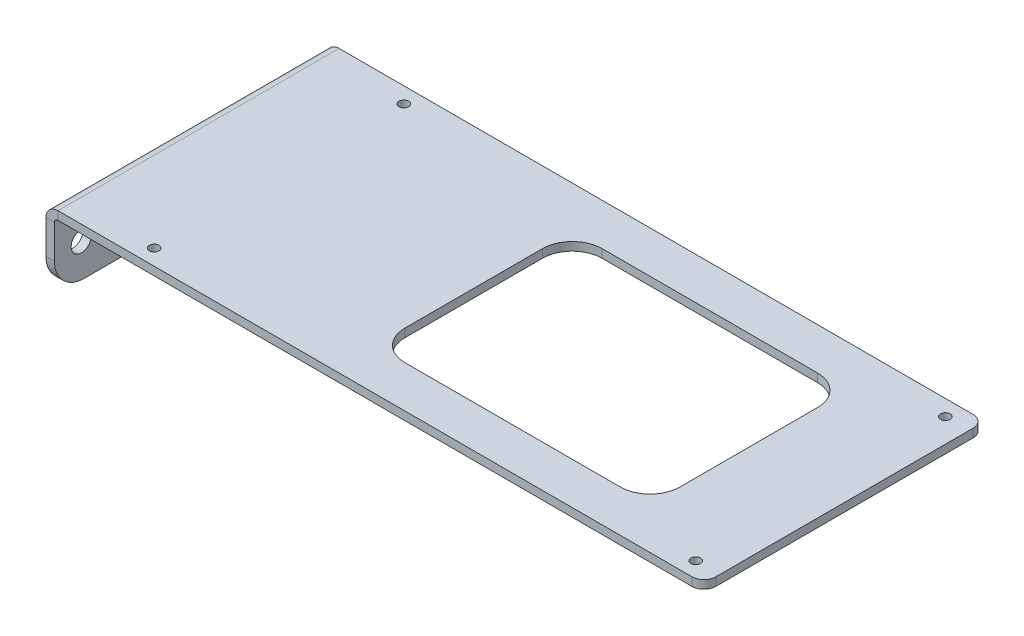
ISO-10303-21;
HEADER;
FILE_DESCRIPTION(('STEP AP214'),'2;1');
FILE_NAME('part.step','',(''),(''),'','','');
FILE_SCHEMA(('AUTOMOTIVE_DESIGN { 1 0 10303 214 1 1 1 1 }'));
ENDSEC;
DATA;
#1=APPLICATION_CONTEXT('core data for automotive mechanical design processes');
#2=APPLICATION_PROTOCOL_DEFINITION('international standard','automotive_design',2000,#1);
#3=PRODUCT_CONTEXT('',#1,'mechanical');
#4=PRODUCT('Part','Part','',(#3));
#5=PRODUCT_RELATED_PRODUCT_CATEGORY('part','',(#4));
#6=PRODUCT_DEFINITION_FORMATION('','',#4);
#7=PRODUCT_DEFINITION_CONTEXT('part definition',#1,'design');
#8=PRODUCT_DEFINITION('design','',#6,#7);
#9=PRODUCT_DEFINITION_SHAPE('','',#8);
#10=(LENGTH_UNIT() NAMED_UNIT(*) SI_UNIT(.MILLI.,.METRE.));
#11=(NAMED_UNIT(*) PLANE_ANGLE_UNIT() SI_UNIT($,.RADIAN.));
#12=(NAMED_UNIT(*) SI_UNIT($,.STERADIAN.) SOLID_ANGLE_UNIT());
#13=UNCERTAINTY_MEASURE_WITH_UNIT(LENGTH_MEASURE(1.E-05),#10,'distance_accuracy_value','');
#14=(GEOMETRIC_REPRESENTATION_CONTEXT(3) GLOBAL_UNCERTAINTY_ASSIGNED_CONTEXT((#13)) GLOBAL_UNIT_ASSIGNED_CONTEXT((#10,
#11,#12)) REPRESENTATION_CONTEXT('',''));
#15=CARTESIAN_POINT('',(0.,0.,0.));
#16=DIRECTION('',(0.,0.,1.));
#17=DIRECTION('',(1.,0.,0.));
#18=AXIS2_PLACEMENT_3D('',#15,#16,#17);
#19=CARTESIAN_POINT('',(0.,-1.778,-29.845));
#20=DIRECTION('',(0.,0.,-1.));
#21=DIRECTION('',(-1.,0.,0.));
#22=AXIS2_PLACEMENT_3D('',#19,#20,#21);
#23=PLANE('',#22);
#24=DIRECTION('',(-1.,0.,0.));
#25=VECTOR('',#24,1.);
#26=CARTESIAN_POINT('',(0.,0.,-29.845));
#27=LINE('',#26,#25);
#28=CARTESIAN_POINT('',(137.16,0.,-29.845));
#29=VERTEX_POINT('',#28);
#30=CARTESIAN_POINT('',(2.54000000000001,0.,-29.845));
#31=VERTEX_POINT('',#30);
#32=EDGE_CURVE('E398',#29,#31,#27,.T.);
#33=ORIENTED_EDGE('',*,*,#32,.F.);
#34=DIRECTION('',(0.,1.,0.));
#35=VECTOR('',#34,1.);
#36=CARTESIAN_POINT('',(137.16,-1.778,-29.845));
#37=LINE('',#36,#35);
#38=CARTESIAN_POINT('',(137.16,-1.778,-29.845));
#39=VERTEX_POINT('',#38);
#40=EDGE_CURVE('E13',#29,#39,#37,.F.);
#41=ORIENTED_EDGE('',*,*,#40,.T.);
#42=DIRECTION('',(-1.,0.,0.));
#43=VECTOR('',#42,1.);
#44=CARTESIAN_POINT('',(0.,-1.778,-29.845));
#45=LINE('',#44,#43);
#46=CARTESIAN_POINT('',(2.54,-1.778,-29.845));
#47=VERTEX_POINT('',#46);
#48=EDGE_CURVE('E400',#39,#47,#45,.T.);
#49=ORIENTED_EDGE('',*,*,#48,.T.);
#50=DIRECTION('',(0.,1.,0.));
#51=VECTOR('',#50,1.);
#52=CARTESIAN_POINT('',(2.54,-1.778,-29.845));
#53=LINE('',#52,#51);
#54=EDGE_CURVE('E373',#47,#31,#53,.T.);
#55=ORIENTED_EDGE('',*,*,#54,.T.);
#56=EDGE_LOOP('',(#33,#41,#49,#55));
#57=FACE_BOUND('',#56,.T.);
#58=ADVANCED_FACE('F67',(#57),#23,.T.);
#59=CARTESIAN_POINT('',(0.,-1.778,0.));
#60=DIRECTION('',(0.,1.,0.));
#61=DIRECTION('',(0.,0.,1.));
#62=AXIS2_PLACEMENT_3D('',#59,#60,#61);
#63=PLANE('',#62);
#64=DIRECTION('',(-1.,0.,0.));
#65=VECTOR('',#64,1.);
#66=CARTESIAN_POINT('',(0.,-1.778,-20.955));
#67=LINE('',#66,#65);
#68=CARTESIAN_POINT('',(113.03,-1.778,-20.955));
#69=VERTEX_POINT('',#68);
#70=CARTESIAN_POINT('',(67.31,-1.778,-20.955));
#71=VERTEX_POINT('',#70);
#72=EDGE_CURVE('E282',#69,#71,#67,.T.);
#73=ORIENTED_EDGE('',*,*,#72,.T.);
#74=CARTESIAN_POINT('',(67.31,-1.778,-14.605));
#75=DIRECTION('',(0.,1.,0.));
#76=DIRECTION('',(0.,0.,1.));
#77=AXIS2_PLACEMENT_3D('',#74,#75,#76);
#78=CIRCLE('',#77,6.35);
#79=CARTESIAN_POINT('',(60.96,-1.778,-14.605));
#80=VERTEX_POINT('',#79);
#81=EDGE_CURVE('E285',#71,#80,#78,.T.);
#82=ORIENTED_EDGE('',*,*,#81,.T.);
#83=DIRECTION('',(0.,0.,1.));
#84=VECTOR('',#83,1.);
#85=CARTESIAN_POINT('',(60.96,-1.778,0.));
#86=LINE('',#85,#84);
#87=CARTESIAN_POINT('',(60.96,-1.778,14.605));
#88=VERTEX_POINT('',#87);
#89=EDGE_CURVE('E257',#80,#88,#86,.T.);
#90=ORIENTED_EDGE('',*,*,#89,.T.);
#91=CARTESIAN_POINT('',(67.31,-1.778,14.605));
#92=DIRECTION('',(0.,1.,0.));
#93=DIRECTION('',(0.,0.,1.));
#94=AXIS2_PLACEMENT_3D('',#91,#92,#93);
#95=CIRCLE('',#94,6.35);
#96=CARTESIAN_POINT('',(67.31,-1.778,20.955));
#97=VERTEX_POINT('',#96);
#98=EDGE_CURVE('E218',#88,#97,#95,.T.);
#99=ORIENTED_EDGE('',*,*,#98,.T.);
#100=DIRECTION('',(1.,0.,0.));
#101=VECTOR('',#100,1.);
#102=CARTESIAN_POINT('',(0.,-1.778,20.955));
#103=LINE('',#102,#101);
#104=CARTESIAN_POINT('',(113.03,-1.778,20.955));
#105=VERTEX_POINT('',#104);
#106=EDGE_CURVE('E270',#97,#105,#103,.T.);
#107=ORIENTED_EDGE('',*,*,#106,.T.);
#108=CARTESIAN_POINT('',(113.03,-1.778,14.605));
#109=DIRECTION('',(0.,1.,0.));
#110=DIRECTION('',(0.,0.,1.));
#111=AXIS2_PLACEMENT_3D('',#108,#109,#110);
#112=CIRCLE('',#111,6.34999999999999);
#113=CARTESIAN_POINT('',(119.38,-1.778,14.605));
#114=VERTEX_POINT('',#113);
#115=EDGE_CURVE('E273',#105,#114,#112,.T.);
#116=ORIENTED_EDGE('',*,*,#115,.T.);
#117=DIRECTION('',(0.,0.,-1.));
#118=VECTOR('',#117,1.);
#119=CARTESIAN_POINT('',(119.38,-1.778,0.));
#120=LINE('',#119,#118);
#121=CARTESIAN_POINT('',(119.38,-1.778,-14.605));
#122=VERTEX_POINT('',#121);
#123=EDGE_CURVE('E276',#114,#122,#120,.T.);
#124=ORIENTED_EDGE('',*,*,#123,.T.);
#125=CARTESIAN_POINT('',(113.03,-1.778,-14.605));
#126=DIRECTION('',(0.,1.,0.));
#127=DIRECTION('',(0.,0.,1.));
#128=AXIS2_PLACEMENT_3D('',#125,#126,#127);
#129=CIRCLE('',#128,6.34999999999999);
#130=EDGE_CURVE('E279',#122,#69,#129,.T.);
#131=ORIENTED_EDGE('',*,*,#130,.T.);
#132=EDGE_LOOP('',(#73,#82,#90,#99,#107,#116,#124,#131));
#133=FACE_BOUND('',#132,.T.);
#134=CARTESIAN_POINT('',(19.62,-1.778,26.5));
#135=DIRECTION('',(0.,-1.,0.));
#136=DIRECTION('',(0.,0.,-1.));
#137=AXIS2_PLACEMENT_3D('',#134,#135,#136);
#138=CIRCLE('',#137,1.025);
#139=CARTESIAN_POINT('',(19.62,-1.778,25.475));
#140=VERTEX_POINT('',#139);
#141=EDGE_CURVE('E302',#140,#140,#138,.T.);
#142=ORIENTED_EDGE('',*,*,#141,.F.);
#143=EDGE_LOOP('',(#142));
#144=FACE_BOUND('',#143,.T.);
#145=CARTESIAN_POINT('',(134.62,-1.778,-26.5));
#146=DIRECTION('',(0.,-1.,0.));
#147=DIRECTION('',(0.,0.,-1.));
#148=AXIS2_PLACEMENT_3D('',#145,#146,#147);
#149=CIRCLE('',#148,1.025);
#150=CARTESIAN_POINT('',(134.62,-1.778,-27.525));
#151=VERTEX_POINT('',#150);
#152=EDGE_CURVE('E310',#151,#151,#149,.T.);
#153=ORIENTED_EDGE('',*,*,#152,.F.);
#154=EDGE_LOOP('',(#153));
#155=FACE_BOUND('',#154,.T.);
#156=CARTESIAN_POINT('',(19.62,-1.778,-26.5));
#157=DIRECTION('',(0.,-1.,0.));
#158=DIRECTION('',(0.,0.,-1.));
#159=AXIS2_PLACEMENT_3D('',#156,#157,#158);
#160=CIRCLE('',#159,1.025);
#161=CARTESIAN_POINT('',(19.62,-1.778,-27.525));
#162=VERTEX_POINT('',#161);
#163=EDGE_CURVE('E316',#162,#162,#160,.T.);
#164=ORIENTED_EDGE('',*,*,#163,.F.);
#165=EDGE_LOOP('',(#164));
#166=FACE_BOUND('',#165,.T.);
#167=CARTESIAN_POINT('',(134.62,-1.778,26.5));
#168=DIRECTION('',(0.,-1.,0.));
#169=DIRECTION('',(0.,0.,-1.));
#170=AXIS2_PLACEMENT_3D('',#167,#168,#169);
#171=CIRCLE('',#170,1.025);
#172=CARTESIAN_POINT('',(134.62,-1.778,25.475));
#173=VERTEX_POINT('',#172);
#174=EDGE_CURVE('E324',#173,#173,#171,.T.);
#175=ORIENTED_EDGE('',*,*,#174,.F.);
#176=EDGE_LOOP('',(#175));
#177=FACE_BOUND('',#176,.T.);
#178=DIRECTION('',(0.,0.,-1.));
#179=VECTOR('',#178,1.);
#180=CARTESIAN_POINT('',(139.7,-1.778,-29.845));
#181=LINE('',#180,#179);
#182=CARTESIAN_POINT('',(139.7,-1.778,27.305));
#183=VERTEX_POINT('',#182);
#184=CARTESIAN_POINT('',(139.7,-1.778,-27.305));
#185=VERTEX_POINT('',#184);
#186=EDGE_CURVE('E397',#183,#185,#181,.T.);
#187=ORIENTED_EDGE('',*,*,#186,.F.);
#188=CARTESIAN_POINT('',(137.16,-1.778,27.305));
#189=DIRECTION('',(0.,1.,0.));
#190=DIRECTION('',(0.,0.,1.));
#191=AXIS2_PLACEMENT_3D('',#188,#189,#190);
#192=CIRCLE('',#191,2.54);
#193=CARTESIAN_POINT('',(137.16,-1.778,29.845));
#194=VERTEX_POINT('',#193);
#195=EDGE_CURVE('E75',#183,#194,#192,.F.);
#196=ORIENTED_EDGE('',*,*,#195,.T.);
#197=DIRECTION('',(1.,0.,0.));
#198=VECTOR('',#197,1.);
#199=CARTESIAN_POINT('',(0.,-1.778,29.845));
#200=LINE('',#199,#198);
#201=CARTESIAN_POINT('',(2.54,-1.778,29.845));
#202=VERTEX_POINT('',#201);
#203=EDGE_CURVE('E393',#202,#194,#200,.T.);
#204=ORIENTED_EDGE('',*,*,#203,.F.);
#205=DIRECTION('',(0.,0.,-1.));
#206=VECTOR('',#205,1.);
#207=CARTESIAN_POINT('',(2.54,-1.778,-29.845));
#208=LINE('',#207,#206);
#209=EDGE_CURVE('E380',#47,#202,#208,.F.);
#210=ORIENTED_EDGE('',*,*,#209,.F.);
#211=ORIENTED_EDGE('',*,*,#48,.F.);
#212=CARTESIAN_POINT('',(137.16,-1.778,-27.305));
#213=DIRECTION('',(0.,1.,0.));
#214=DIRECTION('',(0.,0.,1.));
#215=AXIS2_PLACEMENT_3D('',#212,#213,#214);
#216=CIRCLE('',#215,2.54);
#217=EDGE_CURVE('E87',#39,#185,#216,.F.);
#218=ORIENTED_EDGE('',*,*,#217,.T.);
#219=EDGE_LOOP('',(#187,#196,#204,#210,#211,#218));
#220=FACE_BOUND('',#219,.T.);
#221=ADVANCED_FACE('F446',(#133,#144,#155,#166,#177,#220),#63,.F.);
#222=CARTESIAN_POINT('',(0.,0.,0.));
#223=DIRECTION('',(0.,1.,0.));
#224=DIRECTION('',(0.,0.,1.));
#225=AXIS2_PLACEMENT_3D('',#222,#223,#224);
#226=PLANE('',#225);
#227=CARTESIAN_POINT('',(67.31,0.,-14.605));
#228=DIRECTION('',(0.,1.,0.));
#229=DIRECTION('',(0.,0.,1.));
#230=AXIS2_PLACEMENT_3D('',#227,#228,#229);
#231=CIRCLE('',#230,6.35);
#232=CARTESIAN_POINT('',(67.31,0.,-20.955));
#233=VERTEX_POINT('',#232);
#234=CARTESIAN_POINT('',(60.96,0.,-14.605));
#235=VERTEX_POINT('',#234);
#236=EDGE_CURVE('E231',#233,#235,#231,.T.);
#237=ORIENTED_EDGE('',*,*,#236,.F.);
#238=DIRECTION('',(-1.,0.,0.));
#239=VECTOR('',#238,1.);
#240=CARTESIAN_POINT('',(67.31,0.,-20.955));
#241=LINE('',#240,#239);
#242=CARTESIAN_POINT('',(113.03,0.,-20.955));
#243=VERTEX_POINT('',#242);
#244=EDGE_CURVE('E252',#243,#233,#241,.T.);
#245=ORIENTED_EDGE('',*,*,#244,.F.);
#246=CARTESIAN_POINT('',(113.03,0.,-14.605));
#247=DIRECTION('',(0.,1.,0.));
#248=DIRECTION('',(0.,0.,-1.));
#249=AXIS2_PLACEMENT_3D('',#246,#247,#248);
#250=CIRCLE('',#249,6.34999999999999);
#251=CARTESIAN_POINT('',(119.38,0.,-14.605));
#252=VERTEX_POINT('',#251);
#253=EDGE_CURVE('E249',#252,#243,#250,.T.);
#254=ORIENTED_EDGE('',*,*,#253,.F.);
#255=DIRECTION('',(0.,0.,-1.));
#256=VECTOR('',#255,1.);
#257=CARTESIAN_POINT('',(119.38,0.,-14.605));
#258=LINE('',#257,#256);
#259=CARTESIAN_POINT('',(119.38,0.,14.605));
#260=VERTEX_POINT('',#259);
#261=EDGE_CURVE('E246',#260,#252,#258,.T.);
#262=ORIENTED_EDGE('',*,*,#261,.F.);
#263=CARTESIAN_POINT('',(113.03,0.,14.605));
#264=DIRECTION('',(0.,1.,0.));
#265=DIRECTION('',(0.,0.,1.));
#266=AXIS2_PLACEMENT_3D('',#263,#264,#265);
#267=CIRCLE('',#266,6.34999999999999);
#268=CARTESIAN_POINT('',(113.03,0.,20.955));
#269=VERTEX_POINT('',#268);
#270=EDGE_CURVE('E240',#269,#260,#267,.T.);
#271=ORIENTED_EDGE('',*,*,#270,.F.);
#272=DIRECTION('',(1.,0.,0.));
#273=VECTOR('',#272,1.);
#274=CARTESIAN_POINT('',(67.31,0.,20.955));
#275=LINE('',#274,#273);
#276=CARTESIAN_POINT('',(67.31,0.,20.955));
#277=VERTEX_POINT('',#276);
#278=EDGE_CURVE('E237',#277,#269,#275,.T.);
#279=ORIENTED_EDGE('',*,*,#278,.F.);
#280=CARTESIAN_POINT('',(67.31,0.,14.605));
#281=DIRECTION('',(0.,1.,0.));
#282=DIRECTION('',(0.,0.,1.));
#283=AXIS2_PLACEMENT_3D('',#280,#281,#282);
#284=CIRCLE('',#283,6.35);
#285=CARTESIAN_POINT('',(60.96,0.,14.605));
#286=VERTEX_POINT('',#285);
#287=EDGE_CURVE('E215',#286,#277,#284,.T.);
#288=ORIENTED_EDGE('',*,*,#287,.F.);
#289=DIRECTION('',(0.,0.,1.));
#290=VECTOR('',#289,1.);
#291=CARTESIAN_POINT('',(60.96,0.,-14.605));
#292=LINE('',#291,#290);
#293=EDGE_CURVE('E226',#235,#286,#292,.T.);
#294=ORIENTED_EDGE('',*,*,#293,.F.);
#295=EDGE_LOOP('',(#237,#245,#254,#262,#271,#279,#288,#294));
#296=FACE_BOUND('',#295,.T.);
#297=CARTESIAN_POINT('',(19.62,0.,26.5));
#298=DIRECTION('',(0.,-1.,0.));
#299=DIRECTION('',(0.,0.,-1.));
#300=AXIS2_PLACEMENT_3D('',#297,#298,#299);
#301=CIRCLE('',#300,1.025);
#302=CARTESIAN_POINT('',(19.62,0.,25.475));
#303=VERTEX_POINT('',#302);
#304=EDGE_CURVE('E306',#303,#303,#301,.T.);
#305=ORIENTED_EDGE('',*,*,#304,.T.);
#306=EDGE_LOOP('',(#305));
#307=FACE_BOUND('',#306,.T.);
#308=CARTESIAN_POINT('',(134.62,0.,-26.5));
#309=DIRECTION('',(0.,-1.,0.));
#310=DIRECTION('',(0.,0.,-1.));
#311=AXIS2_PLACEMENT_3D('',#308,#309,#310);
#312=CIRCLE('',#311,1.025);
#313=CARTESIAN_POINT('',(134.62,0.,-27.525));
#314=VERTEX_POINT('',#313);
#315=EDGE_CURVE('E313',#314,#314,#312,.T.);
#316=ORIENTED_EDGE('',*,*,#315,.T.);
#317=EDGE_LOOP('',(#316));
#318=FACE_BOUND('',#317,.T.);
#319=CARTESIAN_POINT('',(19.62,0.,-26.5));
#320=DIRECTION('',(0.,-1.,0.));
#321=DIRECTION('',(0.,0.,-1.));
#322=AXIS2_PLACEMENT_3D('',#319,#320,#321);
#323=CIRCLE('',#322,1.025);
#324=CARTESIAN_POINT('',(19.62,0.,-27.525));
#325=VERTEX_POINT('',#324);
#326=EDGE_CURVE('E320',#325,#325,#323,.T.);
#327=ORIENTED_EDGE('',*,*,#326,.T.);
#328=EDGE_LOOP('',(#327));
#329=FACE_BOUND('',#328,.T.);
#330=CARTESIAN_POINT('',(134.62,0.,26.5));
#331=DIRECTION('',(0.,-1.,0.));
#332=DIRECTION('',(0.,0.,-1.));
#333=AXIS2_PLACEMENT_3D('',#330,#331,#332);
#334=CIRCLE('',#333,1.025);
#335=CARTESIAN_POINT('',(134.62,0.,25.475));
#336=VERTEX_POINT('',#335);
#337=EDGE_CURVE('E327',#336,#336,#334,.T.);
#338=ORIENTED_EDGE('',*,*,#337,.T.);
#339=EDGE_LOOP('',(#338));
#340=FACE_BOUND('',#339,.T.);
#341=DIRECTION('',(1.,0.,0.));
#342=VECTOR('',#341,1.);
#343=CARTESIAN_POINT('',(0.,0.,29.845));
#344=LINE('',#343,#342);
#345=CARTESIAN_POINT('',(2.54,0.,29.845));
#346=VERTEX_POINT('',#345);
#347=CARTESIAN_POINT('',(137.16,0.,29.845));
#348=VERTEX_POINT('',#347);
#349=EDGE_CURVE('E389',#346,#348,#344,.T.);
#350=ORIENTED_EDGE('',*,*,#349,.T.);
#351=CARTESIAN_POINT('',(137.16,0.,27.305));
#352=DIRECTION('',(0.,1.,0.));
#353=DIRECTION('',(0.,0.,1.));
#354=AXIS2_PLACEMENT_3D('',#351,#352,#353);
#355=CIRCLE('',#354,2.54);
#356=CARTESIAN_POINT('',(139.7,0.,27.305));
#357=VERTEX_POINT('',#356);
#358=EDGE_CURVE('E437',#348,#357,#355,.T.);
#359=ORIENTED_EDGE('',*,*,#358,.T.);
#360=DIRECTION('',(0.,0.,-1.));
#361=VECTOR('',#360,1.);
#362=CARTESIAN_POINT('',(139.7,0.,-29.845));
#363=LINE('',#362,#361);
#364=CARTESIAN_POINT('',(139.7,0.,-27.305));
#365=VERTEX_POINT('',#364);
#366=EDGE_CURVE('E407',#357,#365,#363,.T.);
#367=ORIENTED_EDGE('',*,*,#366,.T.);
#368=CARTESIAN_POINT('',(137.16,0.,-27.305));
#369=DIRECTION('',(0.,1.,0.));
#370=DIRECTION('',(0.,0.,1.));
#371=AXIS2_PLACEMENT_3D('',#368,#369,#370);
#372=CIRCLE('',#371,2.54);
#373=EDGE_CURVE('E435',#365,#29,#372,.T.);
#374=ORIENTED_EDGE('',*,*,#373,.T.);
#375=ORIENTED_EDGE('',*,*,#32,.T.);
#376=DIRECTION('',(0.,0.,-1.));
#377=VECTOR('',#376,1.);
#378=CARTESIAN_POINT('',(2.54000000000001,0.,-29.845));
#379=LINE('',#378,#377);
#380=EDGE_CURVE('E365',#31,#346,#379,.F.);
#381=ORIENTED_EDGE('',*,*,#380,.T.);
#382=EDGE_LOOP('',(#350,#359,#367,#374,#375,#381));
#383=FACE_BOUND('',#382,.T.);
#384=ADVANCED_FACE('F233',(#296,#307,#318,#329,#340,#383),#226,.T.);
#385=CARTESIAN_POINT('',(139.7,-1.778,-29.845));
#386=DIRECTION('',(1.,0.,0.));
#387=DIRECTION('',(0.,0.,-1.));
#388=AXIS2_PLACEMENT_3D('',#385,#386,#387);
#389=PLANE('',#388);
#390=ORIENTED_EDGE('',*,*,#366,.F.);
#391=DIRECTION('',(0.,1.,0.));
#392=VECTOR('',#391,1.);
#393=CARTESIAN_POINT('',(139.7,-1.778,27.305));
#394=LINE('',#393,#392);
#395=EDGE_CURVE('E442',#357,#183,#394,.F.);
#396=ORIENTED_EDGE('',*,*,#395,.T.);
#397=ORIENTED_EDGE('',*,*,#186,.T.);
#398=DIRECTION('',(0.,1.,0.));
#399=VECTOR('',#398,1.);
#400=CARTESIAN_POINT('',(139.7,-1.778,-27.305));
#401=LINE('',#400,#399);
#402=EDGE_CURVE('E439',#185,#365,#401,.T.);
#403=ORIENTED_EDGE('',*,*,#402,.T.);
#404=EDGE_LOOP('',(#390,#396,#397,#403));
#405=FACE_BOUND('',#404,.T.);
#406=ADVANCED_FACE('F459',(#405),#389,.T.);
#407=CARTESIAN_POINT('',(0.,-1.778,29.845));
#408=DIRECTION('',(0.,0.,1.));
#409=DIRECTION('',(1.,0.,0.));
#410=AXIS2_PLACEMENT_3D('',#407,#408,#409);
#411=PLANE('',#410);
#412=ORIENTED_EDGE('',*,*,#203,.T.);
#413=DIRECTION('',(0.,1.,0.));
#414=VECTOR('',#413,1.);
#415=CARTESIAN_POINT('',(137.16,-1.778,29.845));
#416=LINE('',#415,#414);
#417=EDGE_CURVE('E432',#194,#348,#416,.T.);
#418=ORIENTED_EDGE('',*,*,#417,.T.);
#419=ORIENTED_EDGE('',*,*,#349,.F.);
#420=DIRECTION('',(0.,1.,0.));
#421=VECTOR('',#420,1.);
#422=CARTESIAN_POINT('',(2.54,-1.778,29.845));
#423=LINE('',#422,#421);
#424=EDGE_CURVE('E386',#202,#346,#423,.T.);
#425=ORIENTED_EDGE('',*,*,#424,.F.);
#426=EDGE_LOOP('',(#412,#418,#419,#425));
#427=FACE_BOUND('',#426,.T.);
#428=ADVANCED_FACE('F453',(#427),#411,.T.);
#429=CARTESIAN_POINT('',(2.54,-2.54,29.845));
#430=DIRECTION('',(0.,0.,1.));
#431=DIRECTION('',(1.,0.,0.));
#432=AXIS2_PLACEMENT_3D('',#429,#430,#431);
#433=PLANE('',#432);
#434=DIRECTION('',(1.,0.,0.));
#435=VECTOR('',#434,1.);
#436=CARTESIAN_POINT('',(0.,-2.53999999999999,29.845));
#437=LINE('',#436,#435);
#438=CARTESIAN_POINT('',(1.778,-2.54,29.845));
#439=VERTEX_POINT('',#438);
#440=CARTESIAN_POINT('',(0.,-2.53999999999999,29.845));
#441=VERTEX_POINT('',#440);
#442=EDGE_CURVE('E330',#439,#441,#437,.F.);
#443=ORIENTED_EDGE('',*,*,#442,.F.);
#444=CARTESIAN_POINT('',(2.54,-2.54,29.845));
#445=DIRECTION('',(0.,0.,-1.));
#446=DIRECTION('',(-1.,0.,0.));
#447=AXIS2_PLACEMENT_3D('',#444,#445,#446);
#448=CIRCLE('',#447,0.762);
#449=EDGE_CURVE('E377',#202,#439,#448,.F.);
#450=ORIENTED_EDGE('',*,*,#449,.F.);
#451=ORIENTED_EDGE('',*,*,#424,.T.);
#452=CARTESIAN_POINT('',(2.54,-2.54,29.845));
#453=DIRECTION('',(0.,0.,-1.));
#454=DIRECTION('',(-1.,0.,0.));
#455=AXIS2_PLACEMENT_3D('',#452,#453,#454);
#456=CIRCLE('',#455,2.54);
#457=EDGE_CURVE('E369',#346,#441,#456,.F.);
#458=ORIENTED_EDGE('',*,*,#457,.T.);
#459=EDGE_LOOP('',(#443,#450,#451,#458));
#460=FACE_BOUND('',#459,.T.);
#461=ADVANCED_FACE('F501',(#460),#433,.T.);
#462=CARTESIAN_POINT('',(2.54,-2.54,-29.845));
#463=DIRECTION('',(0.,0.,1.));
#464=DIRECTION('',(1.,0.,0.));
#465=AXIS2_PLACEMENT_3D('',#462,#463,#464);
#466=PLANE('',#465);
#467=CARTESIAN_POINT('',(2.54,-2.54,-29.845));
#468=DIRECTION('',(0.,0.,-1.));
#469=DIRECTION('',(-1.,0.,0.));
#470=AXIS2_PLACEMENT_3D('',#467,#468,#469);
#471=CIRCLE('',#470,0.762);
#472=CARTESIAN_POINT('',(1.778,-2.54,-29.845));
#473=VERTEX_POINT('',#472);
#474=EDGE_CURVE('E333',#473,#47,#471,.T.);
#475=ORIENTED_EDGE('',*,*,#474,.F.);
#476=DIRECTION('',(1.,0.,0.));
#477=VECTOR('',#476,1.);
#478=CARTESIAN_POINT('',(1.778,-2.54,-29.845));
#479=LINE('',#478,#477);
#480=CARTESIAN_POINT('',(0.,-2.53999999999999,-29.845));
#481=VERTEX_POINT('',#480);
#482=EDGE_CURVE('E356',#473,#481,#479,.F.);
#483=ORIENTED_EDGE('',*,*,#482,.T.);
#484=CARTESIAN_POINT('',(2.54,-2.54,-29.845));
#485=DIRECTION('',(0.,0.,-1.));
#486=DIRECTION('',(-1.,0.,0.));
#487=AXIS2_PLACEMENT_3D('',#484,#485,#486);
#488=CIRCLE('',#487,2.54);
#489=EDGE_CURVE('E370',#481,#31,#488,.T.);
#490=ORIENTED_EDGE('',*,*,#489,.T.);
#491=ORIENTED_EDGE('',*,*,#54,.F.);
#492=EDGE_LOOP('',(#475,#483,#490,#491));
#493=FACE_BOUND('',#492,.T.);
#494=ADVANCED_FACE('F466',(#493),#466,.F.);
#495=CARTESIAN_POINT('',(2.54,-2.54,-29.845));
#496=DIRECTION('',(0.,0.,-1.));
#497=DIRECTION('',(-1.,0.,0.));
#498=AXIS2_PLACEMENT_3D('',#495,#496,#497);
#499=CYLINDRICAL_SURFACE('',#498,2.54);
#500=ORIENTED_EDGE('',*,*,#380,.F.);
#501=ORIENTED_EDGE('',*,*,#489,.F.);
#502=DIRECTION('',(0.,0.,-1.));
#503=VECTOR('',#502,1.);
#504=CARTESIAN_POINT('',(0.,-2.53999999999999,29.845));
#505=LINE('',#504,#503);
#506=EDGE_CURVE('E352',#481,#441,#505,.F.);
#507=ORIENTED_EDGE('',*,*,#506,.T.);
#508=ORIENTED_EDGE('',*,*,#457,.F.);
#509=EDGE_LOOP('',(#500,#501,#507,#508));
#510=FACE_BOUND('',#509,.T.);
#511=ADVANCED_FACE('F503',(#510),#499,.T.);
#512=CARTESIAN_POINT('',(2.54,-2.54,-29.845));
#513=DIRECTION('',(0.,0.,-1.));
#514=DIRECTION('',(-1.,0.,0.));
#515=AXIS2_PLACEMENT_3D('',#512,#513,#514);
#516=CYLINDRICAL_SURFACE('',#515,0.762);
#517=ORIENTED_EDGE('',*,*,#209,.T.);
#518=ORIENTED_EDGE('',*,*,#449,.T.);
#519=DIRECTION('',(0.,0.,-1.));
#520=VECTOR('',#519,1.);
#521=CARTESIAN_POINT('',(1.778,-2.54,29.845));
#522=LINE('',#521,#520);
#523=EDGE_CURVE('E360',#439,#473,#522,.T.);
#524=ORIENTED_EDGE('',*,*,#523,.T.);
#525=ORIENTED_EDGE('',*,*,#474,.T.);
#526=EDGE_LOOP('',(#517,#518,#524,#525));
#527=FACE_BOUND('',#526,.T.);
#528=ADVANCED_FACE('F469',(#527),#516,.F.);
#529=CARTESIAN_POINT('',(0.,-16.002,-29.845));
#530=DIRECTION('',(0.,0.,1.));
#531=DIRECTION('',(0.,-1.,0.));
#532=AXIS2_PLACEMENT_3D('',#529,#530,#531);
#533=PLANE('',#532);
#534=DIRECTION('',(0.,1.,0.));
#535=VECTOR('',#534,1.);
#536=CARTESIAN_POINT('',(1.77799999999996,-16.002,-29.845));
#537=LINE('',#536,#535);
#538=CARTESIAN_POINT('',(1.77799999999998,-9.65200000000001,-29.845));
#539=VERTEX_POINT('',#538);
#540=EDGE_CURVE('E348',#473,#539,#537,.F.);
#541=ORIENTED_EDGE('',*,*,#540,.T.);
#542=DIRECTION('',(1.,0.,0.));
#543=VECTOR('',#542,1.);
#544=CARTESIAN_POINT('',(0.,-9.652,-29.845));
#545=LINE('',#544,#543);
#546=CARTESIAN_POINT('',(0.,-9.652,-29.845));
#547=VERTEX_POINT('',#546);
#548=EDGE_CURVE('E421',#539,#547,#545,.F.);
#549=ORIENTED_EDGE('',*,*,#548,.T.);
#550=DIRECTION('',(0.,-1.,0.));
#551=VECTOR('',#550,1.);
#552=CARTESIAN_POINT('',(0.,0.,-29.845));
#553=LINE('',#552,#551);
#554=EDGE_CURVE('E338',#481,#547,#553,.T.);
#555=ORIENTED_EDGE('',*,*,#554,.F.);
#556=ORIENTED_EDGE('',*,*,#482,.F.);
#557=EDGE_LOOP('',(#541,#549,#555,#556));
#558=FACE_BOUND('',#557,.T.);
#559=ADVANCED_FACE('F479',(#558),#533,.F.);
#560=CARTESIAN_POINT('',(0.,-1.77799999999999,29.845));
#561=DIRECTION('',(0.,0.,-1.));
#562=DIRECTION('',(-1.,0.,0.));
#563=AXIS2_PLACEMENT_3D('',#560,#561,#562);
#564=PLANE('',#563);
#565=DIRECTION('',(0.,1.,0.));
#566=VECTOR('',#565,1.);
#567=CARTESIAN_POINT('',(0.,0.,29.845));
#568=LINE('',#567,#566);
#569=CARTESIAN_POINT('',(0.,-9.652,29.845));
#570=VERTEX_POINT('',#569);
#571=EDGE_CURVE('E331',#570,#441,#568,.T.);
#572=ORIENTED_EDGE('',*,*,#571,.F.);
#573=DIRECTION('',(1.,0.,0.));
#574=VECTOR('',#573,1.);
#575=CARTESIAN_POINT('',(0.,-9.652,29.845));
#576=LINE('',#575,#574);
#577=CARTESIAN_POINT('',(1.77799999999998,-9.65200000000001,29.845));
#578=VERTEX_POINT('',#577);
#579=EDGE_CURVE('E429',#570,#578,#576,.T.);
#580=ORIENTED_EDGE('',*,*,#579,.T.);
#581=DIRECTION('',(0.,-1.,0.));
#582=VECTOR('',#581,1.);
#583=CARTESIAN_POINT('',(1.77800000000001,-1.778,29.845));
#584=LINE('',#583,#582);
#585=EDGE_CURVE('E342',#578,#439,#584,.F.);
#586=ORIENTED_EDGE('',*,*,#585,.T.);
#587=ORIENTED_EDGE('',*,*,#442,.T.);
#588=EDGE_LOOP('',(#572,#580,#586,#587));
#589=FACE_BOUND('',#588,.T.);
#590=ADVANCED_FACE('F498',(#589),#564,.F.);
#591=CARTESIAN_POINT('',(0.,0.,0.));
#592=DIRECTION('',(1.,0.,0.));
#593=DIRECTION('',(0.,1.,0.));
#594=AXIS2_PLACEMENT_3D('',#591,#592,#593);
#595=PLANE('',#594);
#596=CARTESIAN_POINT('',(0.,-8.84108137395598,24.13));
#597=DIRECTION('',(1.,0.,0.));
#598=DIRECTION('',(0.,0.,-1.));
#599=AXIS2_PLACEMENT_3D('',#596,#597,#598);
#600=CIRCLE('',#599,2.15265);
#601=CARTESIAN_POINT('',(0.,-8.84108137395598,21.97735));
#602=VERTEX_POINT('',#601);
#603=EDGE_CURVE('E291',#602,#602,#600,.T.);
#604=ORIENTED_EDGE('',*,*,#603,.T.);
#605=EDGE_LOOP('',(#604));
#606=FACE_BOUND('',#605,.T.);
#607=CARTESIAN_POINT('',(0.,-8.84108137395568,-24.13));
#608=DIRECTION('',(1.,0.,0.));
#609=DIRECTION('',(0.,0.,-1.));
#610=AXIS2_PLACEMENT_3D('',#607,#608,#609);
#611=CIRCLE('',#610,2.15265);
#612=CARTESIAN_POINT('',(0.,-8.84108137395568,-26.28265));
#613=VERTEX_POINT('',#612);
#614=EDGE_CURVE('E298',#613,#613,#611,.T.);
#615=ORIENTED_EDGE('',*,*,#614,.T.);
#616=EDGE_LOOP('',(#615));
#617=FACE_BOUND('',#616,.T.);
#618=ORIENTED_EDGE('',*,*,#554,.T.);
#619=CARTESIAN_POINT('',(0.,-9.652,-23.495));
#620=DIRECTION('',(1.,0.,0.));
#621=DIRECTION('',(0.,1.,0.));
#622=AXIS2_PLACEMENT_3D('',#619,#620,#621);
#623=CIRCLE('',#622,6.35);
#624=CARTESIAN_POINT('',(0.,-16.002,-23.495));
#625=VERTEX_POINT('',#624);
#626=EDGE_CURVE('E426',#547,#625,#623,.F.);
#627=ORIENTED_EDGE('',*,*,#626,.T.);
#628=DIRECTION('',(0.,0.,1.));
#629=VECTOR('',#628,1.);
#630=CARTESIAN_POINT('',(0.,-16.002,0.));
#631=LINE('',#630,#629);
#632=CARTESIAN_POINT('',(0.,-16.002,23.495));
#633=VERTEX_POINT('',#632);
#634=EDGE_CURVE('E334',#625,#633,#631,.T.);
#635=ORIENTED_EDGE('',*,*,#634,.T.);
#636=CARTESIAN_POINT('',(0.,-9.652,23.495));
#637=DIRECTION('',(1.,0.,0.));
#638=DIRECTION('',(0.,1.,0.));
#639=AXIS2_PLACEMENT_3D('',#636,#637,#638);
#640=CIRCLE('',#639,6.35);
#641=EDGE_CURVE('E424',#633,#570,#640,.F.);
#642=ORIENTED_EDGE('',*,*,#641,.T.);
#643=ORIENTED_EDGE('',*,*,#571,.T.);
#644=ORIENTED_EDGE('',*,*,#506,.F.);
#645=EDGE_LOOP('',(#618,#627,#635,#642,#643,#644));
#646=FACE_BOUND('',#645,.T.);
#647=ADVANCED_FACE('F487',(#606,#617,#646),#595,.F.);
#648=CARTESIAN_POINT('',(1.77800000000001,0.,0.));
#649=DIRECTION('',(1.,0.,0.));
#650=DIRECTION('',(0.,1.,0.));
#651=AXIS2_PLACEMENT_3D('',#648,#649,#650);
#652=PLANE('',#651);
#653=CARTESIAN_POINT('',(1.77799999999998,-8.84108137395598,24.13));
#654=DIRECTION('',(1.,0.,0.));
#655=DIRECTION('',(0.,0.,-1.));
#656=AXIS2_PLACEMENT_3D('',#653,#654,#655);
#657=CIRCLE('',#656,2.15264999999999);
#658=CARTESIAN_POINT('',(1.77799999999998,-8.84108137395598,21.97735));
#659=VERTEX_POINT('',#658);
#660=EDGE_CURVE('E288',#659,#659,#657,.T.);
#661=ORIENTED_EDGE('',*,*,#660,.F.);
#662=EDGE_LOOP('',(#661));
#663=FACE_BOUND('',#662,.T.);
#664=CARTESIAN_POINT('',(1.77799999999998,-8.84108137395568,-24.13));
#665=DIRECTION('',(1.,0.,0.));
#666=DIRECTION('',(0.,0.,-1.));
#667=AXIS2_PLACEMENT_3D('',#664,#665,#666);
#668=CIRCLE('',#667,2.15264999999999);
#669=CARTESIAN_POINT('',(1.77799999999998,-8.84108137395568,-26.28265));
#670=VERTEX_POINT('',#669);
#671=EDGE_CURVE('E294',#670,#670,#668,.T.);
#672=ORIENTED_EDGE('',*,*,#671,.F.);
#673=EDGE_LOOP('',(#672));
#674=FACE_BOUND('',#673,.T.);
#675=DIRECTION('',(0.,0.,-1.));
#676=VECTOR('',#675,1.);
#677=CARTESIAN_POINT('',(1.77799999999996,-16.002,29.845));
#678=LINE('',#677,#676);
#679=CARTESIAN_POINT('',(1.77799999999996,-16.002,-23.495));
#680=VERTEX_POINT('',#679);
#681=CARTESIAN_POINT('',(1.77799999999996,-16.002,23.495));
#682=VERTEX_POINT('',#681);
#683=EDGE_CURVE('E344',#680,#682,#678,.F.);
#684=ORIENTED_EDGE('',*,*,#683,.F.);
#685=CARTESIAN_POINT('',(1.77799999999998,-9.65200000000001,-23.495));
#686=DIRECTION('',(1.,0.,0.));
#687=DIRECTION('',(0.,1.,0.));
#688=AXIS2_PLACEMENT_3D('',#685,#686,#687);
#689=CIRCLE('',#688,6.35);
#690=EDGE_CURVE('E418',#680,#539,#689,.T.);
#691=ORIENTED_EDGE('',*,*,#690,.T.);
#692=ORIENTED_EDGE('',*,*,#540,.F.);
#693=ORIENTED_EDGE('',*,*,#523,.F.);
#694=ORIENTED_EDGE('',*,*,#585,.F.);
#695=CARTESIAN_POINT('',(1.77799999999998,-9.65200000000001,23.495));
#696=DIRECTION('',(1.,0.,0.));
#697=DIRECTION('',(0.,1.,0.));
#698=AXIS2_PLACEMENT_3D('',#695,#696,#697);
#699=CIRCLE('',#698,6.35);
#700=EDGE_CURVE('E416',#578,#682,#699,.T.);
#701=ORIENTED_EDGE('',*,*,#700,.T.);
#702=EDGE_LOOP('',(#684,#691,#692,#693,#694,#701));
#703=FACE_BOUND('',#702,.T.);
#704=ADVANCED_FACE('F476',(#663,#674,#703),#652,.T.);
#705=CARTESIAN_POINT('',(0.,-16.002,29.845));
#706=DIRECTION('',(0.,1.,0.));
#707=DIRECTION('',(-1.,0.,0.));
#708=AXIS2_PLACEMENT_3D('',#705,#706,#707);
#709=PLANE('',#708);
#710=ORIENTED_EDGE('',*,*,#634,.F.);
#711=DIRECTION('',(1.,0.,0.));
#712=VECTOR('',#711,1.);
#713=CARTESIAN_POINT('',(0.,-16.002,-23.495));
#714=LINE('',#713,#712);
#715=EDGE_CURVE('E413',#625,#680,#714,.T.);
#716=ORIENTED_EDGE('',*,*,#715,.T.);
#717=ORIENTED_EDGE('',*,*,#683,.T.);
#718=DIRECTION('',(1.,0.,0.));
#719=VECTOR('',#718,1.);
#720=CARTESIAN_POINT('',(0.,-16.002,23.495));
#721=LINE('',#720,#719);
#722=EDGE_CURVE('E403',#682,#633,#721,.F.);
#723=ORIENTED_EDGE('',*,*,#722,.T.);
#724=EDGE_LOOP('',(#710,#716,#717,#723));
#725=FACE_BOUND('',#724,.T.);
#726=ADVANCED_FACE('F491',(#725),#709,.F.);
#727=CARTESIAN_POINT('',(134.62,-1.778,26.5));
#728=DIRECTION('',(0.,-1.,0.));
#729=DIRECTION('',(0.,0.,-1.));
#730=AXIS2_PLACEMENT_3D('',#727,#728,#729);
#731=CYLINDRICAL_SURFACE('',#730,1.025);
#732=ORIENTED_EDGE('',*,*,#337,.F.);
#733=EDGE_LOOP('',(#732));
#734=FACE_BOUND('',#733,.T.);
#735=ORIENTED_EDGE('',*,*,#174,.T.);
#736=EDGE_LOOP('',(#735));
#737=FACE_BOUND('',#736,.T.);
#738=ADVANCED_FACE('F566',(#734,#737),#731,.F.);
#739=CARTESIAN_POINT('',(19.62,-1.778,-26.5));
#740=DIRECTION('',(0.,-1.,0.));
#741=DIRECTION('',(0.,0.,-1.));
#742=AXIS2_PLACEMENT_3D('',#739,#740,#741);
#743=CYLINDRICAL_SURFACE('',#742,1.025);
#744=ORIENTED_EDGE('',*,*,#326,.F.);
#745=EDGE_LOOP('',(#744));
#746=FACE_BOUND('',#745,.T.);
#747=ORIENTED_EDGE('',*,*,#163,.T.);
#748=EDGE_LOOP('',(#747));
#749=FACE_BOUND('',#748,.T.);
#750=ADVANCED_FACE('F562',(#746,#749),#743,.F.);
#751=CARTESIAN_POINT('',(134.62,-1.778,-26.5));
#752=DIRECTION('',(0.,-1.,0.));
#753=DIRECTION('',(0.,0.,-1.));
#754=AXIS2_PLACEMENT_3D('',#751,#752,#753);
#755=CYLINDRICAL_SURFACE('',#754,1.025);
#756=ORIENTED_EDGE('',*,*,#315,.F.);
#757=EDGE_LOOP('',(#756));
#758=FACE_BOUND('',#757,.T.);
#759=ORIENTED_EDGE('',*,*,#152,.T.);
#760=EDGE_LOOP('',(#759));
#761=FACE_BOUND('',#760,.T.);
#762=ADVANCED_FACE('F558',(#758,#761),#755,.F.);
#763=CARTESIAN_POINT('',(19.62,-1.778,26.5));
#764=DIRECTION('',(0.,-1.,0.));
#765=DIRECTION('',(0.,0.,-1.));
#766=AXIS2_PLACEMENT_3D('',#763,#764,#765);
#767=CYLINDRICAL_SURFACE('',#766,1.025);
#768=ORIENTED_EDGE('',*,*,#304,.F.);
#769=EDGE_LOOP('',(#768));
#770=FACE_BOUND('',#769,.T.);
#771=ORIENTED_EDGE('',*,*,#141,.T.);
#772=EDGE_LOOP('',(#771));
#773=FACE_BOUND('',#772,.T.);
#774=ADVANCED_FACE('F528',(#770,#773),#767,.F.);
#775=CARTESIAN_POINT('',(0.,-9.652,-23.495));
#776=DIRECTION('',(1.,0.,0.));
#777=DIRECTION('',(0.,1.,0.));
#778=AXIS2_PLACEMENT_3D('',#775,#776,#777);
#779=CYLINDRICAL_SURFACE('',#778,6.35);
#780=ORIENTED_EDGE('',*,*,#626,.F.);
#781=ORIENTED_EDGE('',*,*,#548,.F.);
#782=ORIENTED_EDGE('',*,*,#690,.F.);
#783=ORIENTED_EDGE('',*,*,#715,.F.);
#784=EDGE_LOOP('',(#780,#781,#782,#783));
#785=FACE_BOUND('',#784,.T.);
#786=ADVANCED_FACE('F483',(#785),#779,.T.);
#787=CARTESIAN_POINT('',(0.,-9.652,23.495));
#788=DIRECTION('',(1.,0.,0.));
#789=DIRECTION('',(0.,1.,0.));
#790=AXIS2_PLACEMENT_3D('',#787,#788,#789);
#791=CYLINDRICAL_SURFACE('',#790,6.35);
#792=ORIENTED_EDGE('',*,*,#641,.F.);
#793=ORIENTED_EDGE('',*,*,#722,.F.);
#794=ORIENTED_EDGE('',*,*,#700,.F.);
#795=ORIENTED_EDGE('',*,*,#579,.F.);
#796=EDGE_LOOP('',(#792,#793,#794,#795));
#797=FACE_BOUND('',#796,.T.);
#798=ADVANCED_FACE('F494',(#797),#791,.T.);
#799=CARTESIAN_POINT('',(1.77799999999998,-8.84108137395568,-24.13));
#800=DIRECTION('',(1.,0.,0.));
#801=DIRECTION('',(0.,0.,-1.));
#802=AXIS2_PLACEMENT_3D('',#799,#800,#801);
#803=CYLINDRICAL_SURFACE('',#802,2.15264999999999);
#804=ORIENTED_EDGE('',*,*,#614,.F.);
#805=EDGE_LOOP('',(#804));
#806=FACE_BOUND('',#805,.T.);
#807=ORIENTED_EDGE('',*,*,#671,.T.);
#808=EDGE_LOOP('',(#807));
#809=FACE_BOUND('',#808,.T.);
#810=ADVANCED_FACE('F530',(#806,#809),#803,.F.);
#811=CARTESIAN_POINT('',(1.77799999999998,-8.84108137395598,24.13));
#812=DIRECTION('',(1.,0.,0.));
#813=DIRECTION('',(0.,0.,-1.));
#814=AXIS2_PLACEMENT_3D('',#811,#812,#813);
#815=CYLINDRICAL_SURFACE('',#814,2.15264999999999);
#816=ORIENTED_EDGE('',*,*,#603,.F.);
#817=EDGE_LOOP('',(#816));
#818=FACE_BOUND('',#817,.T.);
#819=ORIENTED_EDGE('',*,*,#660,.T.);
#820=EDGE_LOOP('',(#819));
#821=FACE_BOUND('',#820,.T.);
#822=ADVANCED_FACE('F548',(#818,#821),#815,.F.);
#823=CARTESIAN_POINT('',(67.31,-16.002,-14.605));
#824=DIRECTION('',(0.,1.,0.));
#825=DIRECTION('',(0.,0.,1.));
#826=AXIS2_PLACEMENT_3D('',#823,#824,#825);
#827=CYLINDRICAL_SURFACE('',#826,6.35);
#828=DIRECTION('',(0.,1.,0.));
#829=VECTOR('',#828,1.);
#830=CARTESIAN_POINT('',(67.31,-16.002,-20.955));
#831=LINE('',#830,#829);
#832=EDGE_CURVE('E255',#71,#233,#831,.T.);
#833=ORIENTED_EDGE('',*,*,#832,.T.);
#834=ORIENTED_EDGE('',*,*,#236,.T.);
#835=DIRECTION('',(0.,1.,0.));
#836=VECTOR('',#835,1.);
#837=CARTESIAN_POINT('',(60.96,-16.002,-14.605));
#838=LINE('',#837,#836);
#839=EDGE_CURVE('E222',#80,#235,#838,.T.);
#840=ORIENTED_EDGE('',*,*,#839,.F.);
#841=ORIENTED_EDGE('',*,*,#81,.F.);
#842=EDGE_LOOP('',(#833,#834,#840,#841));
#843=FACE_BOUND('',#842,.T.);
#844=ADVANCED_FACE('F544',(#843),#827,.F.);
#845=CARTESIAN_POINT('',(67.31,-16.002,-20.955));
#846=DIRECTION('',(0.,0.,-1.));
#847=DIRECTION('',(-1.,0.,0.));
#848=AXIS2_PLACEMENT_3D('',#845,#846,#847);
#849=PLANE('',#848);
#850=DIRECTION('',(0.,1.,0.));
#851=VECTOR('',#850,1.);
#852=CARTESIAN_POINT('',(113.03,-16.002,-20.955));
#853=LINE('',#852,#851);
#854=EDGE_CURVE('E258',#69,#243,#853,.T.);
#855=ORIENTED_EDGE('',*,*,#854,.T.);
#856=ORIENTED_EDGE('',*,*,#244,.T.);
#857=ORIENTED_EDGE('',*,*,#832,.F.);
#858=ORIENTED_EDGE('',*,*,#72,.F.);
#859=EDGE_LOOP('',(#855,#856,#857,#858));
#860=FACE_BOUND('',#859,.T.);
#861=ADVANCED_FACE('F547',(#860),#849,.F.);
#862=CARTESIAN_POINT('',(113.03,-16.002,-14.605));
#863=DIRECTION('',(0.,1.,0.));
#864=DIRECTION('',(0.,0.,1.));
#865=AXIS2_PLACEMENT_3D('',#862,#863,#864);
#866=CYLINDRICAL_SURFACE('',#865,6.34999999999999);
#867=DIRECTION('',(0.,1.,0.));
#868=VECTOR('',#867,1.);
#869=CARTESIAN_POINT('',(119.38,-16.002,-14.605));
#870=LINE('',#869,#868);
#871=EDGE_CURVE('E260',#122,#252,#870,.T.);
#872=ORIENTED_EDGE('',*,*,#871,.T.);
#873=ORIENTED_EDGE('',*,*,#253,.T.);
#874=ORIENTED_EDGE('',*,*,#854,.F.);
#875=ORIENTED_EDGE('',*,*,#130,.F.);
#876=EDGE_LOOP('',(#872,#873,#874,#875));
#877=FACE_BOUND('',#876,.T.);
#878=ADVANCED_FACE('F641',(#877),#866,.F.);
#879=CARTESIAN_POINT('',(119.38,-16.002,-14.605));
#880=DIRECTION('',(1.,0.,0.));
#881=DIRECTION('',(0.,0.,-1.));
#882=AXIS2_PLACEMENT_3D('',#879,#880,#881);
#883=PLANE('',#882);
#884=DIRECTION('',(0.,1.,0.));
#885=VECTOR('',#884,1.);
#886=CARTESIAN_POINT('',(119.38,-16.002,14.605));
#887=LINE('',#886,#885);
#888=EDGE_CURVE('E262',#114,#260,#887,.T.);
#889=ORIENTED_EDGE('',*,*,#888,.T.);
#890=ORIENTED_EDGE('',*,*,#261,.T.);
#891=ORIENTED_EDGE('',*,*,#871,.F.);
#892=ORIENTED_EDGE('',*,*,#123,.F.);
#893=EDGE_LOOP('',(#889,#890,#891,#892));
#894=FACE_BOUND('',#893,.T.);
#895=ADVANCED_FACE('F649',(#894),#883,.F.);
#896=CARTESIAN_POINT('',(113.03,-16.002,14.605));
#897=DIRECTION('',(0.,1.,0.));
#898=DIRECTION('',(0.,0.,1.));
#899=AXIS2_PLACEMENT_3D('',#896,#897,#898);
#900=CYLINDRICAL_SURFACE('',#899,6.34999999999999);
#901=DIRECTION('',(0.,1.,0.));
#902=VECTOR('',#901,1.);
#903=CARTESIAN_POINT('',(113.03,-16.002,20.955));
#904=LINE('',#903,#902);
#905=EDGE_CURVE('E264',#105,#269,#904,.T.);
#906=ORIENTED_EDGE('',*,*,#905,.T.);
#907=ORIENTED_EDGE('',*,*,#270,.T.);
#908=ORIENTED_EDGE('',*,*,#888,.F.);
#909=ORIENTED_EDGE('',*,*,#115,.F.);
#910=EDGE_LOOP('',(#906,#907,#908,#909));
#911=FACE_BOUND('',#910,.T.);
#912=ADVANCED_FACE('F657',(#911),#900,.F.);
#913=CARTESIAN_POINT('',(67.31,-16.002,20.955));
#914=DIRECTION('',(0.,0.,1.));
#915=DIRECTION('',(1.,0.,0.));
#916=AXIS2_PLACEMENT_3D('',#913,#914,#915);
#917=PLANE('',#916);
#918=DIRECTION('',(0.,1.,0.));
#919=VECTOR('',#918,1.);
#920=CARTESIAN_POINT('',(67.31,-16.002,20.955));
#921=LINE('',#920,#919);
#922=EDGE_CURVE('E221',#97,#277,#921,.T.);
#923=ORIENTED_EDGE('',*,*,#922,.T.);
#924=ORIENTED_EDGE('',*,*,#278,.T.);
#925=ORIENTED_EDGE('',*,*,#905,.F.);
#926=ORIENTED_EDGE('',*,*,#106,.F.);
#927=EDGE_LOOP('',(#923,#924,#925,#926));
#928=FACE_BOUND('',#927,.T.);
#929=ADVANCED_FACE('F540',(#928),#917,.F.);
#930=CARTESIAN_POINT('',(67.31,-16.002,14.605));
#931=DIRECTION('',(0.,1.,0.));
#932=DIRECTION('',(0.,0.,1.));
#933=AXIS2_PLACEMENT_3D('',#930,#931,#932);
#934=CYLINDRICAL_SURFACE('',#933,6.35);
#935=DIRECTION('',(0.,1.,0.));
#936=VECTOR('',#935,1.);
#937=CARTESIAN_POINT('',(60.96,-16.002,14.605));
#938=LINE('',#937,#936);
#939=EDGE_CURVE('E210',#88,#286,#938,.T.);
#940=ORIENTED_EDGE('',*,*,#939,.T.);
#941=ORIENTED_EDGE('',*,*,#287,.T.);
#942=ORIENTED_EDGE('',*,*,#922,.F.);
#943=ORIENTED_EDGE('',*,*,#98,.F.);
#944=EDGE_LOOP('',(#940,#941,#942,#943));
#945=FACE_BOUND('',#944,.T.);
#946=ADVANCED_FACE('F212',(#945),#934,.F.);
#947=CARTESIAN_POINT('',(60.96,-16.002,-14.605));
#948=DIRECTION('',(-1.,0.,0.));
#949=DIRECTION('',(0.,0.,1.));
#950=AXIS2_PLACEMENT_3D('',#947,#948,#949);
#951=PLANE('',#950);
#952=ORIENTED_EDGE('',*,*,#839,.T.);
#953=ORIENTED_EDGE('',*,*,#293,.T.);
#954=ORIENTED_EDGE('',*,*,#939,.F.);
#955=ORIENTED_EDGE('',*,*,#89,.F.);
#956=EDGE_LOOP('',(#952,#953,#954,#955));
#957=FACE_BOUND('',#956,.T.);
#958=ADVANCED_FACE('F227',(#957),#951,.F.);
#959=CARTESIAN_POINT('',(137.16,-1.778,27.305));
#960=DIRECTION('',(0.,1.,0.));
#961=DIRECTION('',(0.,0.,1.));
#962=AXIS2_PLACEMENT_3D('',#959,#960,#961);
#963=CYLINDRICAL_SURFACE('',#962,2.54);
#964=ORIENTED_EDGE('',*,*,#195,.F.);
#965=ORIENTED_EDGE('',*,*,#395,.F.);
#966=ORIENTED_EDGE('',*,*,#358,.F.);
#967=ORIENTED_EDGE('',*,*,#417,.F.);
#968=EDGE_LOOP('',(#964,#965,#966,#967));
#969=FACE_BOUND('',#968,.T.);
#970=ADVANCED_FACE('F455',(#969),#963,.T.);
#971=CARTESIAN_POINT('',(137.16,-1.778,-27.305));
#972=DIRECTION('',(0.,1.,0.));
#973=DIRECTION('',(0.,0.,1.));
#974=AXIS2_PLACEMENT_3D('',#971,#972,#973);
#975=CYLINDRICAL_SURFACE('',#974,2.54);
#976=ORIENTED_EDGE('',*,*,#217,.F.);
#977=ORIENTED_EDGE('',*,*,#40,.F.);
#978=ORIENTED_EDGE('',*,*,#373,.F.);
#979=ORIENTED_EDGE('',*,*,#402,.F.);
#980=EDGE_LOOP('',(#976,#977,#978,#979));
#981=FACE_BOUND('',#980,.T.);
#982=ADVANCED_FACE('F69',(#981),#975,.T.);
#983=CLOSED_SHELL('',(#58,#221,#384,#406,#428,#461,#494,#511,#528,#559,#590,#647,#704,#726,#738,
#750,#762,#774,#786,#798,#810,#822,#844,#861,#878,#895,#912,#929,#946,#958,#970,#982));
#984=MANIFOLD_SOLID_BREP('B2',#983);
#985=ADVANCED_BREP_SHAPE_REPRESENTATION('',(#18,#984),#14);
#986=SHAPE_DEFINITION_REPRESENTATION(#9,#985);
ENDSEC;
END-ISO-10303-21;
